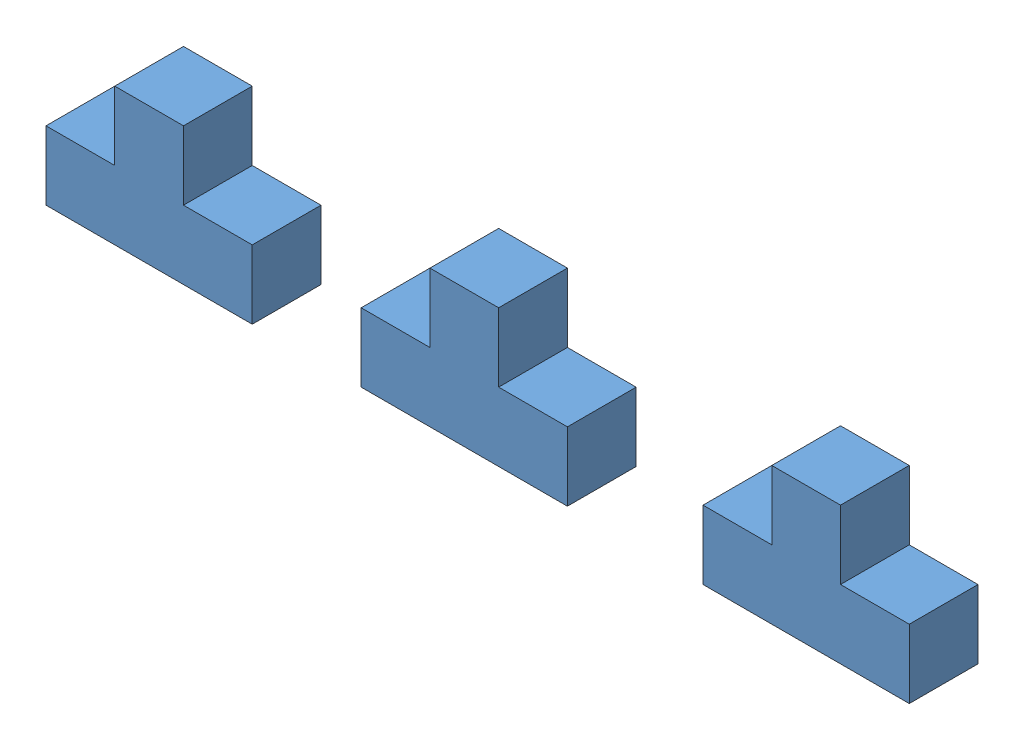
SolidWorks assembly Assem1.sldasm, configuration Default (file format 3400). Lengths in mm.
Overall size (637.9 101.6 50.8).
3 component instances, 1 part files, 4 mates.
Components (placement in the parent):
- T Block-1: T Block.SLDPRT [Default] at (-5.2545 -61.2309 9.8593) size (152.4 101.6 50.8)
- T Block-2: T Block.SLDPRT [Default] at (247.3493 -61.2309 9.8593) size (152.4 101.6 50.8)
- T Block-3: T Block.SLDPRT [Default] at (-238.1476 -61.2309 9.8593) size (152.4 101.6 50.8)
Mates (geometry in assembly coordinates):
- Coincident1: coincident aligned: plane of T Block-1 through (-5.2545 -61.2309 35.2593) normal (0 -1 0); plane of T Block-2 through (247.3493 -61.2309 35.2593) normal (0 -1 0)
- Coincident2: coincident aligned: plane of T Block-1 through (-5.2545 -152.9412 35.2593) normal (0 0 1); plane of T Block-2 through (247.3493 -152.9412 35.2593) normal (0 0 1)
- Coincident3: coincident aligned: plane of T Block-1 through (-5.2545 -152.9412 35.2593) normal (0 0 1); plane of T Block-3 through (-238.1476 -152.9412 35.2593) normal (0 0 1)
- Coincident4: coincident aligned: plane of T Block-1 through (-5.2545 -61.2309 35.2593) normal (0 -1 0); plane of T Block-3 through (-238.1476 -61.2309 35.2593) normal (0 -1 0)
